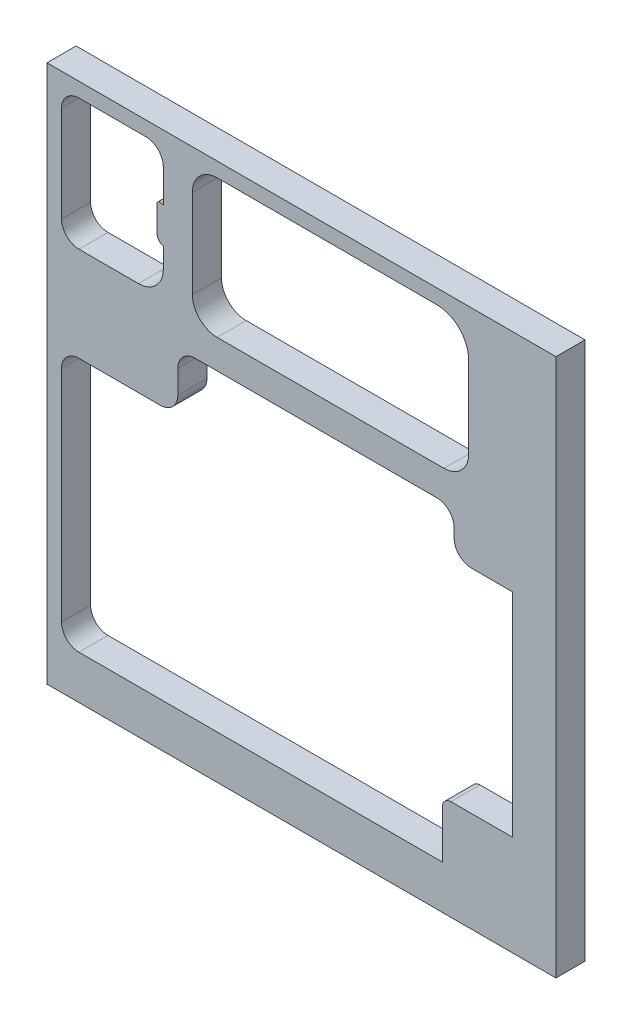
from build123d import *

# Parameters (mm, degrees)
SKETCH1_W           = 222.25
SKETCH1_H           = 234.95
BOSS_EXTRUDE1_DEPTH = 12.7


with BuildPart() as part:
    # Sketch1 → Boss-Extrude1 (new body)
    with BuildSketch(Plane.XY):
        with Locations((-92.075, 98.425)):
            Rectangle(SKETCH1_W, SKETCH1_H)
        with BuildLine():
            Line((-189.23, 0), (-30.48, 0))
            Line((-30.48, 0), (-30.48, 21.018521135))
            ThreePointArc((-30.48, 21.018521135), (-29.401274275, 23.62279541), (-26.797, 24.701521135))
            Line((-26.797, 24.701521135), (0, 24.701521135))
            Line((0, 24.701521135), (0, 117.475))
            Line((0, 117.475), (-17.78, 117.475))
            ThreePointArc((-17.78, 117.475), (-23.168153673, 119.706846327), (-25.4, 125.095))
            Line((-25.4, 125.095), (-25.4, 128.905))
            ThreePointArc((-25.4, 128.905), (-27.631846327, 134.293153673), (-33.02, 136.525))
            Line((-33.02, 136.525), (-138.43, 136.525))
            ThreePointArc((-138.43, 136.525), (-143.818153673, 134.293153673), (-146.05, 128.905))
            Line((-146.05, 128.905), (-146.05, 118.745))
            ThreePointArc((-146.05, 118.745), (-148.281846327, 113.356846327), (-153.67, 111.125))
            Line((-153.67, 111.125), (-189.23, 111.125))
            ThreePointArc((-189.23, 111.125), (-194.618153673, 108.893153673), (-196.85, 103.505))
            Line((-196.85, 103.505), (-196.85, 7.62))
            ThreePointArc((-196.85, 7.62), (-194.618153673, 2.231846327), (-189.23, 0))
        make_face(mode=Mode.SUBTRACT)
        with BuildLine():
            Line((-153.624681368, 187.831774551), (-152.4, 187.485854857))
            Line((-152.4, 187.485854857), (-152.4, 201.93))
            ThreePointArc((-152.4, 201.93), (-154.631846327, 207.318153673), (-160.02, 209.55))
            Line((-160.02, 209.55), (-189.23, 209.55))
            ThreePointArc((-189.23, 209.55), (-194.618153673, 207.318153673), (-196.85, 201.93))
            Line((-196.85, 201.93), (-196.85, 160.02))
            ThreePointArc((-196.85, 160.02), (-194.618153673, 154.631846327), (-189.23, 152.4))
            Line((-189.23, 152.4), (-163.195, 152.4))
            ThreePointArc((-163.195, 152.4), (-155.561782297, 155.561782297), (-152.4, 163.195))
            Line((-152.4, 163.195), (-152.4, 171.92359545))
            ThreePointArc((-152.4, 171.92359545), (-153.148180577, 172.265524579), (-153.839644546, 172.71113347))
            ThreePointArc((-153.839644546, 172.71113347), (-154.767399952, 173.824225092), (-155.10002, 175.234567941))
            Line((-155.10002, 175.234567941), (-155.10002, 186.715432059))
            ThreePointArc((-155.10002, 186.715432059), (-154.639953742, 187.64047863), (-153.624681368, 187.831774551))
        make_face(mode=Mode.SUBTRACT)
        with BuildLine():
            Line((-139.7, 198.755), (-139.7, 160.02))
            ThreePointArc((-139.7, 160.02), (-136.538217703, 152.386782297), (-128.905, 149.225))
            Line((-128.905, 149.225), (-29.845, 149.225))
            ThreePointArc((-29.845, 149.225), (-22.211782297, 152.386782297), (-19.05, 160.02))
            Line((-19.05, 160.02), (-19.05, 195.58))
            ThreePointArc((-19.05, 195.58), (-23.141718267, 205.458281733), (-33.02, 209.55))
            Line((-33.02, 209.55), (-128.905, 209.55))
            ThreePointArc((-128.905, 209.55), (-136.538217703, 206.388217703), (-139.7, 198.755))
        make_face(mode=Mode.SUBTRACT)
    extrude(amount=-BOSS_EXTRUDE1_DEPTH)


solid = part.part
